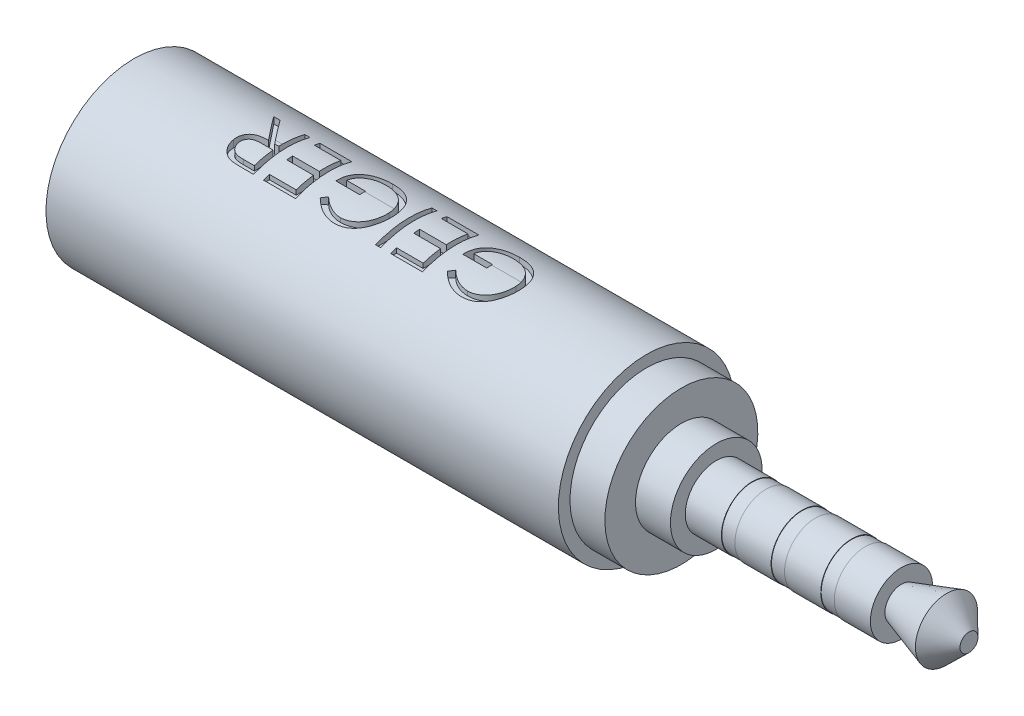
from build123d import *

# Parameters (mm, degrees)
SKETCH2_W          = 0.284935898
SKETCH2_H          = 3.175
CUT_EXTRUDE1_DEPTH = 33.643847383


with BuildPart() as part:
    # Sketch1 → Revolve1 (revolve)
    with BuildSketch(Plane.XY):
        Polygon((0, 2.58445), (0, 4.31165), (-1.9685, 4.31165), (-1.9685, 4.9657), (-30.861, 4.9657), (-30.861, 0), (0, 0), (16.2179, 0), (16.2179, 0.508), (14.9479, 1.75), (12.4079, 0.93339), (12.4079, 1.75), (10.36955, 1.75), (10.36955, 1.7246), (9.60755, 1.7246), (9.60755, 1.75), (7.5692, 1.75), (7.5692, 1.7246), (6.8072, 1.7246), (6.8072, 1.75), (4.76885, 1.75), (4.76885, 1.7246), (4.00685, 1.7246), (4.00685, 1.75), (1.9685, 1.75), (1.9685, 2.58445), align=None)
    revolve(axis=Axis((-30.861, 0, 0), (-1, 0, 0)))

    # Sketch2 → Cut-Extrude1 (cut, through all)
    # profile 1 of 6: a face of its own
    with BuildSketch(Plane(origin=(0, 4.445, 0), x_dir=(1, 0, 0), z_dir=(0, 1, 0))):
        with BuildLine():
            Line((-22.215230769, -1.905), (-22.85061238, -1.905))
            add(Edge.make_bspline(
                [(-22.85061238, -1.905), (-22.893013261, -1.904858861), (-22.974427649, -1.904587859), (-23.091061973, -1.903076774), (-23.197040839, -1.898745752), (-23.292308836, -1.89501868), (-23.376864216, -1.888222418), (-23.450966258, -1.881726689), (-23.51427367, -1.873223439), (-23.552596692, -1.865326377), (-23.569948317, -1.861750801)],
                knots=[0, 0, 0, 0, 1.410062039, 2.707475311, 3.878576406, 4.937260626, 5.877586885, 6.699081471, 7.410979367, 8, 8, 8, 8], degree=3))
            add(Edge.make_bspline(
                [(-23.569948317, -1.861750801), (-23.593177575, -1.856012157), (-23.639140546, -1.844657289), (-23.705311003, -1.820645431), (-23.76839136, -1.792903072), (-23.828150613, -1.760069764), (-23.884573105, -1.722699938), (-23.93765315, -1.680643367), (-23.986679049, -1.633539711), (-24.033395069, -1.583340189), (-24.074187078, -1.527859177), (-24.110910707, -1.469912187), (-24.141738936, -1.408383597), (-24.165997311, -1.343583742), (-24.186333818, -1.276148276), (-24.200001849, -1.205410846), (-24.208514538, -1.131601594), (-24.209355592, -1.081380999), (-24.209782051, -1.055916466)],
                knots=[0, 0, 0, 0, 1.027276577, 2.032638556, 3.019345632, 3.985365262, 4.957888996, 5.923693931, 6.890056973, 7.876427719, 8.865527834, 9.843495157, 10.821038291, 11.815616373, 12.812734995, 13.843357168, 14.906466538, 16, 16, 16, 16], degree=3))
            add(Edge.make_bspline(
                [(-24.209782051, -1.055916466), (-24.208449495, -1.013611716), (-24.205849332, -0.93106419), (-24.181605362, -0.811266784), (-24.141895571, -0.699513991), (-24.087167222, -0.595961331), (-24.01750507, -0.502572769), (-23.933787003, -0.420823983), (-23.836440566, -0.351783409), (-23.745391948, -0.30441549), (-23.664926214, -0.273936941), (-23.598487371, -0.252384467), (-23.525958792, -0.236013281), (-23.44838101, -0.22113416), (-23.365154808, -0.209780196), (-23.276447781, -0.201716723), (-23.182038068, -0.196531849), (-23.117322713, -0.195774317), (-23.084030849, -0.195384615)],
                knots=[0, 0, 0, 0, 1.260402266, 2.459371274, 3.627181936, 4.786749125, 5.93865593, 7.087644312, 8.261344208, 9.485713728, 10.136162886, 10.825977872, 11.566646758, 12.35154167, 13.181268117, 14.0701832, 15.007234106, 16, 16, 16, 16], degree=3))
            Line((-23.084030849, -0.195384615), (-24.250487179, 1.27))
            Line((-24.250487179, 1.27), (-23.898133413, 1.27))
            Line((-23.898133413, 1.27), (-22.731677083, -0.195384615))
            Line((-22.731677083, -0.195384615), (-22.500166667, -0.195384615))
            Line((-22.500166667, -0.195384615), (-22.500166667, 1.27))
            Line((-22.500166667, 1.27), (-22.215230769, 1.27))
            Line((-22.215230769, 1.27), (-22.215230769, -1.905))
        make_face()
        with BuildLine():
            Line((-22.500166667, -1.579358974), (-22.500166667, -0.521025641))
            Line((-22.500166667, -0.521025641), (-23.081486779, -0.516573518))
            add(Edge.make_bspline(
                [(-23.081486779, -0.516573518), (-23.108628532, -0.516561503), (-23.16123698, -0.516538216), (-23.237346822, -0.520161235), (-23.308213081, -0.524282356), (-23.373563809, -0.530587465), (-23.433431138, -0.538708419), (-23.487775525, -0.548882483), (-23.536717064, -0.56068556), (-23.59361546, -0.579140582), (-23.657882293, -0.607118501), (-23.726285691, -0.650500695), (-23.786102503, -0.702965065), (-23.835833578, -0.76371599), (-23.875777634, -0.830797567), (-23.903522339, -0.902691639), (-23.921805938, -0.978265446), (-23.923821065, -1.030155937), (-23.924846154, -1.056552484)],
                knots=[0, 0, 0, 0, 1.146399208, 2.222048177, 3.218135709, 4.144938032, 4.994811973, 5.769438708, 6.479732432, 7.119818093, 8.294689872, 9.430121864, 10.527913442, 11.641375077, 12.733452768, 13.811150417, 14.886538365, 16, 16, 16, 16], degree=3))
            add(Edge.make_bspline(
                [(-23.924846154, -1.056552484), (-23.923769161, -1.082090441), (-23.921634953, -1.132697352), (-23.903813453, -1.206617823), (-23.874713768, -1.276906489), (-23.834883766, -1.342596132), (-23.785311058, -1.401783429), (-23.727570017, -1.452270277), (-23.66301942, -1.494213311), (-23.603176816, -1.521887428), (-23.549297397, -1.538170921), (-23.502732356, -1.54999109), (-23.449659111, -1.558269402), (-23.390702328, -1.565883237), (-23.325603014, -1.572330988), (-23.254321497, -1.576610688), (-23.176908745, -1.579168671), (-23.123254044, -1.579294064), (-23.095479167, -1.579358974)],
                knots=[0, 0, 0, 0, 1.100596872, 2.180981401, 3.259506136, 4.371595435, 5.481727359, 6.576991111, 7.667816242, 8.793363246, 9.406619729, 10.09427138, 10.864108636, 11.721733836, 12.6590937, 13.685439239, 14.801845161, 16, 16, 16, 16], degree=3))
            Line((-23.095479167, -1.579358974), (-22.500166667, -1.579358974))
        make_face(mode=Mode.SUBTRACT)
    # profile 2 of 6: a face of its own
    with BuildSketch(Plane(origin=(0, 4.445, 0), x_dir=(1, 0, 0), z_dir=(0, 1, 0))):
        Polygon((-19.854333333, -1.905), (-21.645358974, -1.905), (-21.645358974, -1.579358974), (-20.139269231, -1.579358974), (-20.139269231, -0.602435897), (-21.645358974, -0.602435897), (-21.645358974, -0.276794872), (-20.139269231, -0.276794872), (-20.139269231, 0.944358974), (-21.645358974, 0.944358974), (-21.645358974, 1.27), (-19.854333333, 1.27), align=None)
    # profile 3 of 6: a face of its own
    with BuildSketch(Plane(origin=(0, 4.445, 0), x_dir=(1, 0, 0), z_dir=(0, 1, 0))):
        with BuildLine():
            Line((-18.999525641, -1.363112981), (-18.755294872, -1.131602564))
            add(Edge.make_bspline(
                [(-18.755294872, -1.131602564), (-18.710841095, -1.173120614), (-18.623229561, -1.254946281), (-18.481075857, -1.36229787), (-18.332555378, -1.453543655), (-18.178875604, -1.528509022), (-18.023000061, -1.586782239), (-17.868040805, -1.628916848), (-17.715084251, -1.656014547), (-17.613538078, -1.659197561), (-17.563397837, -1.660769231)],
                knots=[0, 0, 0, 0, 1.091957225, 2.152079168, 3.193085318, 4.218301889, 5.218403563, 6.17723952, 7.099979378, 8, 8, 8, 8], degree=3))
            add(Edge.make_bspline(
                [(-17.563397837, -1.660769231), (-17.532632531, -1.660393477), (-17.471181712, -1.659642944), (-17.379900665, -1.650086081), (-17.289589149, -1.636298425), (-17.200558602, -1.616554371), (-17.112455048, -1.590910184), (-17.025474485, -1.559948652), (-16.939784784, -1.522677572), (-16.855836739, -1.48018513), (-16.774037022, -1.433797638), (-16.697103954, -1.382061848), (-16.624716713, -1.326569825), (-16.557387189, -1.266593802), (-16.494193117, -1.203132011), (-16.436291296, -1.135282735), (-16.382415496, -1.064050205), (-16.334580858, -0.988413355), (-16.291345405, -0.91052128), (-16.253907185, -0.830994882), (-16.22167071, -0.750395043), (-16.195911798, -0.668676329), (-16.175202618, -0.585890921), (-16.160544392, -0.502168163), (-16.152311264, -0.417095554), (-16.150884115, -0.360129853), (-16.150166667, -0.331492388)],
                knots=[0, 0, 0, 0, 1.028307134, 2.053947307, 3.065600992, 4.082111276, 5.100671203, 6.132125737, 7.167228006, 8.222953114, 9.277225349, 10.309459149, 11.320441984, 12.324791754, 13.322338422, 14.312705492, 15.305176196, 16.306142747, 17.302479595, 18.282363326, 19.243345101, 20.20291386, 21.145121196, 22.094978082, 23.042318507, 24, 24, 24, 24], degree=3))
            add(Edge.make_bspline(
                [(-16.150166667, -0.331492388), (-16.150858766, -0.30221993), (-16.152241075, -0.243754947), (-16.16090648, -0.156466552), (-16.177530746, -0.070652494), (-16.197837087, 0.014496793), (-16.226580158, 0.09789449), (-16.259993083, 0.180761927), (-16.30028158, 0.262328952), (-16.346674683, 0.342027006), (-16.397944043, 0.419585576), (-16.454322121, 0.493257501), (-16.515915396, 0.562181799), (-16.581591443, 0.627366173), (-16.651949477, 0.688398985), (-16.727671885, 0.744544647), (-16.807698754, 0.796671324), (-16.892065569, 0.844206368), (-16.979880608, 0.886667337), (-17.06992037, 0.924426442), (-17.162474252, 0.955522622), (-17.257055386, 0.980866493), (-17.353551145, 1.001640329), (-17.452451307, 1.015004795), (-17.553028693, 1.024702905), (-17.620827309, 1.025411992), (-17.654984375, 1.025769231)],
                knots=[0, 0, 0, 0, 0.935896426, 1.86923723, 2.799743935, 3.728471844, 4.66505513, 5.616527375, 6.583419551, 7.570341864, 8.562833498, 9.553750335, 10.533080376, 11.5155245, 12.510142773, 13.507781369, 14.526649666, 15.561487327, 16.601173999, 17.643331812, 18.680652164, 19.71969803, 20.772446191, 21.833473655, 22.9085001, 24, 24, 24, 24], degree=3))
            add(Edge.make_bspline(
                [(-17.654984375, 1.025769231), (-17.696149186, 1.024909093), (-17.776982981, 1.023220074), (-17.895804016, 1.010061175), (-18.009934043, 0.98953574), (-18.119001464, 0.959383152), (-18.223402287, 0.921217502), (-18.322750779, 0.874019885), (-18.417323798, 0.818288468), (-18.506702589, 0.755145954), (-18.588796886, 0.68481178), (-18.663415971, 0.609530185), (-18.728373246, 0.528700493), (-18.784092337, 0.442340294), (-18.83205043, 0.351721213), (-18.870305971, 0.255290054), (-18.899894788, 0.154123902), (-18.911999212, 0.084185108), (-18.918115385, 0.048846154)],
                knots=[0, 0, 0, 0, 1.130234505, 2.219399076, 3.279128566, 4.311639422, 5.322903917, 6.328167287, 7.327698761, 8.334124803, 9.329374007, 10.292761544, 11.24113083, 12.171311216, 13.111441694, 14.052040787, 15.015727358, 16, 16, 16, 16], degree=3))
            Line((-18.918115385, 0.048846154), (-17.859782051, 0.048846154))
            Line((-17.859782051, 0.048846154), (-17.859782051, -0.276794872))
            Line((-17.859782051, -0.276794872), (-19.203051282, -0.276794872))
            add(Edge.make_bspline(
                [(-19.203051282, -0.276794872), (-19.201503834, -0.216100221), (-19.198475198, -0.097309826), (-19.177230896, 0.075927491), (-19.142925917, 0.239550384), (-19.096062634, 0.393731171), (-19.035397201, 0.538251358), (-18.961580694, 0.67325768), (-18.873431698, 0.797877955), (-18.774090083, 0.913129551), (-18.662602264, 1.015935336), (-18.541980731, 1.106292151), (-18.412026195, 1.182403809), (-18.272861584, 1.244325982), (-18.124942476, 1.292653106), (-17.967926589, 1.326917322), (-17.802026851, 1.347445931), (-17.68832858, 1.350068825), (-17.630179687, 1.351410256)],
                knots=[0, 0, 0, 0, 1.140356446, 2.231883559, 3.274166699, 4.278491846, 5.25512956, 6.21435461, 7.1637429, 8.11826594, 9.068280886, 10.0076534, 10.945064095, 11.891975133, 12.864533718, 13.863980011, 14.907571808, 16, 16, 16, 16], degree=3))
            add(Edge.make_bspline(
                [(-17.630179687, 1.351410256), (-17.59433835, 1.350893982), (-17.523647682, 1.349875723), (-17.419243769, 1.342639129), (-17.317718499, 1.331498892), (-17.219086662, 1.314675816), (-17.122985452, 1.29407038), (-17.029894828, 1.26768457), (-16.939460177, 1.23714225), (-16.851541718, 1.202402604), (-16.766937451, 1.162151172), (-16.685270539, 1.117420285), (-16.606089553, 1.068440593), (-16.529933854, 1.01436504), (-16.45640664, 0.955598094), (-16.385982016, 0.892021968), (-16.318265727, 0.823831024), (-16.275847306, 0.775408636), (-16.254473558, 0.751009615)],
                knots=[0, 0, 0, 0, 1.107784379, 2.184907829, 3.233506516, 4.263428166, 5.276301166, 6.270063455, 7.25232949, 8.225834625, 9.190232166, 10.146266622, 11.1027726, 12.066435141, 13.031522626, 14.010570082, 14.99756817, 16, 16, 16, 16], degree=3))
            add(Edge.make_bspline(
                [(-16.254473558, 0.751009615), (-16.223462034, 0.712301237), (-16.161953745, 0.635527), (-16.082779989, 0.512518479), (-16.015287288, 0.385153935), (-15.960525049, 0.253078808), (-15.917764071, 0.116416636), (-15.88709697, -0.02465795), (-15.869128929, -0.170326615), (-15.866540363, -0.268901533), (-15.865230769, -0.318772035)],
                knots=[0, 0, 0, 0, 1.023165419, 2.029347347, 3.013907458, 3.994755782, 4.975994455, 5.96558838, 6.970761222, 8, 8, 8, 8], degree=3))
            add(Edge.make_bspline(
                [(-15.865230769, -0.318772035), (-15.865714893, -0.356115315), (-15.866676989, -0.430327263), (-15.87829232, -0.540512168), (-15.895057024, -0.648713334), (-15.919340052, -0.755030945), (-15.951290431, -0.858992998), (-15.989661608, -0.961398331), (-16.03460517, -1.061837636), (-16.087052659, -1.159420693), (-16.144141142, -1.254114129), (-16.208336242, -1.342937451), (-16.276071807, -1.427608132), (-16.350592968, -1.50572898), (-16.429107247, -1.579795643), (-16.513567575, -1.64785595), (-16.602588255, -1.711058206), (-16.696888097, -1.768165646), (-16.794971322, -1.819481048), (-16.896626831, -1.864464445), (-17.001817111, -1.901642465), (-17.109755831, -1.93318717), (-17.221259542, -1.956514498), (-17.335519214, -1.973431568), (-17.453130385, -1.985007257), (-17.532628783, -1.985938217), (-17.572938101, -1.986410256)],
                knots=[0, 0, 0, 0, 1.009025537, 2.005226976, 2.991671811, 3.967589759, 4.950148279, 5.929425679, 6.922109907, 7.921964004, 8.922507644, 9.908469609, 10.882248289, 11.851158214, 12.824245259, 13.798023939, 14.780666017, 15.773333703, 16.775582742, 17.771174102, 18.775387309, 19.789283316, 20.80873549, 21.851817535, 22.910773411, 24, 24, 24, 24], degree=3))
            add(Edge.make_bspline(
                [(-17.572938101, -1.986410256), (-17.605811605, -1.985885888), (-17.670995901, -1.984846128), (-17.767989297, -1.977601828), (-17.86329253, -1.966246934), (-17.957383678, -1.950369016), (-18.049904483, -1.929365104), (-18.141135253, -1.903767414), (-18.23090344, -1.874130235), (-18.31910225, -1.838756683), (-18.406331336, -1.798613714), (-18.493073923, -1.753425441), (-18.579034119, -1.702421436), (-18.66436086, -1.645449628), (-18.749592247, -1.583488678), (-18.833380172, -1.514766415), (-18.917747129, -1.441992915), (-18.971995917, -1.389666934), (-18.999525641, -1.363112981)],
                knots=[0, 0, 0, 0, 0.985875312, 1.954874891, 2.915472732, 3.863573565, 4.815313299, 5.759461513, 6.704487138, 7.649063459, 8.607849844, 9.583336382, 10.581114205, 11.603942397, 12.659508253, 13.739925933, 14.853076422, 16, 16, 16, 16], degree=3))
        make_face()
    # profile 4 of 6: a face of its own
    with BuildSketch(Plane(origin=(0, 4.445, 0), x_dir=(1, 0, 0), z_dir=(0, 1, 0))):
        with Locations((-15.193596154, -0.3175)):
            Rectangle(SKETCH2_W, SKETCH2_H)
    # profile 5 of 6: a face of its own
    with BuildSketch(Plane(origin=(0, 4.445, 0), x_dir=(1, 0, 0), z_dir=(0, 1, 0))):
        Polygon((-12.690230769, -1.905), (-14.48125641, -1.905), (-14.48125641, -1.579358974), (-12.975166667, -1.579358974), (-12.975166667, -0.602435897), (-14.48125641, -0.602435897), (-14.48125641, -0.276794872), (-12.975166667, -0.276794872), (-12.975166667, 0.944358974), (-14.48125641, 0.944358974), (-14.48125641, 1.27), (-12.690230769, 1.27), align=None)
    # profile 6 of 6: a face of its own
    with BuildSketch(Plane(origin=(0, 4.445, 0), x_dir=(1, 0, 0), z_dir=(0, 1, 0))):
        with BuildLine():
            Line((-11.835423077, -1.363112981), (-11.591192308, -1.131602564))
            add(Edge.make_bspline(
                [(-11.591192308, -1.131602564), (-11.546738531, -1.173120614), (-11.459126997, -1.254946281), (-11.316973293, -1.36229787), (-11.168452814, -1.453543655), (-11.01477304, -1.528509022), (-10.858897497, -1.586782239), (-10.703938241, -1.628916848), (-10.550981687, -1.656014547), (-10.449435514, -1.659197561), (-10.399295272, -1.660769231)],
                knots=[0, 0, 0, 0, 1.091957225, 2.152079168, 3.193085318, 4.218301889, 5.218403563, 6.17723952, 7.099979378, 8, 8, 8, 8], degree=3))
            add(Edge.make_bspline(
                [(-10.399295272, -1.660769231), (-10.368529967, -1.660393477), (-10.307079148, -1.659642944), (-10.2157981, -1.650086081), (-10.125486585, -1.636298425), (-10.036456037, -1.616554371), (-9.948352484, -1.590910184), (-9.86137192, -1.559948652), (-9.77568222, -1.522677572), (-9.691734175, -1.48018513), (-9.609934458, -1.433797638), (-9.53300139, -1.382061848), (-9.460614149, -1.326569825), (-9.393284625, -1.266593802), (-9.330090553, -1.203132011), (-9.272188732, -1.135282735), (-9.218312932, -1.064050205), (-9.170478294, -0.988413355), (-9.127242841, -0.91052128), (-9.089804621, -0.830994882), (-9.057568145, -0.750395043), (-9.031809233, -0.668676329), (-9.011100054, -0.585890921), (-8.996441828, -0.502168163), (-8.9882087, -0.417095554), (-8.986781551, -0.360129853), (-8.986064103, -0.331492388)],
                knots=[0, 0, 0, 0, 1.028307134, 2.053947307, 3.065600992, 4.082111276, 5.100671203, 6.132125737, 7.167228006, 8.222953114, 9.277225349, 10.309459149, 11.320441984, 12.324791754, 13.322338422, 14.312705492, 15.305176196, 16.306142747, 17.302479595, 18.282363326, 19.243345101, 20.20291386, 21.145121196, 22.094978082, 23.042318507, 24, 24, 24, 24], degree=3))
            add(Edge.make_bspline(
                [(-8.986064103, -0.331492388), (-8.986756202, -0.30221993), (-8.988138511, -0.243754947), (-8.996803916, -0.156466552), (-9.013428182, -0.070652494), (-9.033734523, 0.014496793), (-9.062477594, 0.09789449), (-9.095890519, 0.180761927), (-9.136179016, 0.262328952), (-9.182572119, 0.342027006), (-9.233841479, 0.419585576), (-9.290219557, 0.493257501), (-9.351812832, 0.562181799), (-9.417488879, 0.627366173), (-9.487846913, 0.688398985), (-9.56356932, 0.744544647), (-9.643596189, 0.796671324), (-9.727963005, 0.844206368), (-9.815778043, 0.886667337), (-9.905817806, 0.924426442), (-9.998371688, 0.955522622), (-10.092952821, 0.980866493), (-10.189448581, 1.001640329), (-10.288348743, 1.015004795), (-10.388926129, 1.024702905), (-10.456724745, 1.025411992), (-10.490881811, 1.025769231)],
                knots=[0, 0, 0, 0, 0.935896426, 1.86923723, 2.799743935, 3.728471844, 4.66505513, 5.616527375, 6.583419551, 7.570341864, 8.562833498, 9.553750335, 10.533080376, 11.5155245, 12.510142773, 13.507781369, 14.526649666, 15.561487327, 16.601173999, 17.643331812, 18.680652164, 19.71969803, 20.772446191, 21.833473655, 22.9085001, 24, 24, 24, 24], degree=3))
            add(Edge.make_bspline(
                [(-10.490881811, 1.025769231), (-10.532046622, 1.024909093), (-10.612880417, 1.023220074), (-10.731701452, 1.010061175), (-10.845831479, 0.98953574), (-10.954898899, 0.959383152), (-11.059299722, 0.921217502), (-11.158648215, 0.874019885), (-11.253221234, 0.818288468), (-11.342600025, 0.755145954), (-11.424694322, 0.68481178), (-11.499313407, 0.609530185), (-11.564270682, 0.528700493), (-11.619989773, 0.442340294), (-11.667947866, 0.351721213), (-11.706203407, 0.255290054), (-11.735792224, 0.154123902), (-11.747896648, 0.084185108), (-11.754012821, 0.048846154)],
                knots=[0, 0, 0, 0, 1.130234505, 2.219399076, 3.279128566, 4.311639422, 5.322903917, 6.328167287, 7.327698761, 8.334124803, 9.329374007, 10.292761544, 11.24113083, 12.171311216, 13.111441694, 14.052040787, 15.015727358, 16, 16, 16, 16], degree=3))
            Line((-11.754012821, 0.048846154), (-10.695679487, 0.048846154))
            Line((-10.695679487, 0.048846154), (-10.695679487, -0.276794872))
            Line((-10.695679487, -0.276794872), (-12.038948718, -0.276794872))
            add(Edge.make_bspline(
                [(-12.038948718, -0.276794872), (-12.03740127, -0.216100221), (-12.034372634, -0.097309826), (-12.013128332, 0.075927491), (-11.978823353, 0.239550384), (-11.93196007, 0.393731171), (-11.871294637, 0.538251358), (-11.797478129, 0.67325768), (-11.709329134, 0.797877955), (-11.609987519, 0.913129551), (-11.4984997, 1.015935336), (-11.377878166, 1.106292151), (-11.247923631, 1.182403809), (-11.10875902, 1.244325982), (-10.960839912, 1.292653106), (-10.803824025, 1.326917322), (-10.637924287, 1.347445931), (-10.524226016, 1.350068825), (-10.466077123, 1.351410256)],
                knots=[0, 0, 0, 0, 1.140356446, 2.231883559, 3.274166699, 4.278491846, 5.25512956, 6.21435461, 7.1637429, 8.11826594, 9.068280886, 10.0076534, 10.945064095, 11.891975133, 12.864533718, 13.863980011, 14.907571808, 16, 16, 16, 16], degree=3))
            add(Edge.make_bspline(
                [(-10.466077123, 1.351410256), (-10.430235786, 1.350893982), (-10.359545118, 1.349875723), (-10.255141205, 1.342639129), (-10.153615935, 1.331498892), (-10.054984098, 1.314675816), (-9.958882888, 1.29407038), (-9.865792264, 1.26768457), (-9.775357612, 1.23714225), (-9.687439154, 1.202402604), (-9.602834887, 1.162151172), (-9.521167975, 1.117420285), (-9.441986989, 1.068440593), (-9.36583129, 1.01436504), (-9.292304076, 0.955598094), (-9.221879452, 0.892021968), (-9.154163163, 0.823831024), (-9.111744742, 0.775408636), (-9.090370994, 0.751009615)],
                knots=[0, 0, 0, 0, 1.107784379, 2.184907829, 3.233506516, 4.263428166, 5.276301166, 6.270063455, 7.25232949, 8.225834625, 9.190232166, 10.146266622, 11.1027726, 12.066435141, 13.031522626, 14.010570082, 14.99756817, 16, 16, 16, 16], degree=3))
            add(Edge.make_bspline(
                [(-9.090370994, 0.751009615), (-9.05935947, 0.712301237), (-8.997851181, 0.635527), (-8.918677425, 0.512518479), (-8.851184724, 0.385153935), (-8.796422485, 0.253078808), (-8.753661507, 0.116416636), (-8.722994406, -0.02465795), (-8.705026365, -0.170326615), (-8.702437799, -0.268901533), (-8.701128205, -0.318772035)],
                knots=[0, 0, 0, 0, 1.023165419, 2.029347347, 3.013907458, 3.994755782, 4.975994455, 5.96558838, 6.970761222, 8, 8, 8, 8], degree=3))
            add(Edge.make_bspline(
                [(-8.701128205, -0.318772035), (-8.701612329, -0.356115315), (-8.702574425, -0.430327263), (-8.714189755, -0.540512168), (-8.73095446, -0.648713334), (-8.755237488, -0.755030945), (-8.787187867, -0.858992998), (-8.825559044, -0.961398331), (-8.870502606, -1.061837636), (-8.922950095, -1.159420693), (-8.980038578, -1.254114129), (-9.044233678, -1.342937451), (-9.111969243, -1.427608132), (-9.186490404, -1.50572898), (-9.265004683, -1.579795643), (-9.349465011, -1.64785595), (-9.438485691, -1.711058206), (-9.532785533, -1.768165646), (-9.630868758, -1.819481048), (-9.732524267, -1.864464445), (-9.837714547, -1.901642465), (-9.945653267, -1.93318717), (-10.057156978, -1.956514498), (-10.17141665, -1.973431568), (-10.289027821, -1.985007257), (-10.368526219, -1.985938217), (-10.408835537, -1.986410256)],
                knots=[0, 0, 0, 0, 1.009025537, 2.005226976, 2.991671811, 3.967589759, 4.950148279, 5.929425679, 6.922109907, 7.921964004, 8.922507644, 9.908469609, 10.882248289, 11.851158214, 12.824245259, 13.798023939, 14.780666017, 15.773333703, 16.775582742, 17.771174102, 18.775387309, 19.789283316, 20.80873549, 21.851817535, 22.910773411, 24, 24, 24, 24], degree=3))
            add(Edge.make_bspline(
                [(-10.408835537, -1.986410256), (-10.441709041, -1.985885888), (-10.506893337, -1.984846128), (-10.603886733, -1.977601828), (-10.699189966, -1.966246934), (-10.793281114, -1.950369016), (-10.885801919, -1.929365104), (-10.977032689, -1.903767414), (-11.066800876, -1.874130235), (-11.154999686, -1.838756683), (-11.242228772, -1.798613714), (-11.328971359, -1.753425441), (-11.414931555, -1.702421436), (-11.500258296, -1.645449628), (-11.585489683, -1.583488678), (-11.669277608, -1.514766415), (-11.753644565, -1.441992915), (-11.807893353, -1.389666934), (-11.835423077, -1.363112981)],
                knots=[0, 0, 0, 0, 0.985875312, 1.954874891, 2.915472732, 3.863573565, 4.815313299, 5.759461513, 6.704487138, 7.649063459, 8.607849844, 9.583336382, 10.581114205, 11.603942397, 12.659508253, 13.739925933, 14.853076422, 16, 16, 16, 16], degree=3))
        make_face()
    extrude(amount=CUT_EXTRUDE1_DEPTH, mode=Mode.SUBTRACT)


solid = part.part
